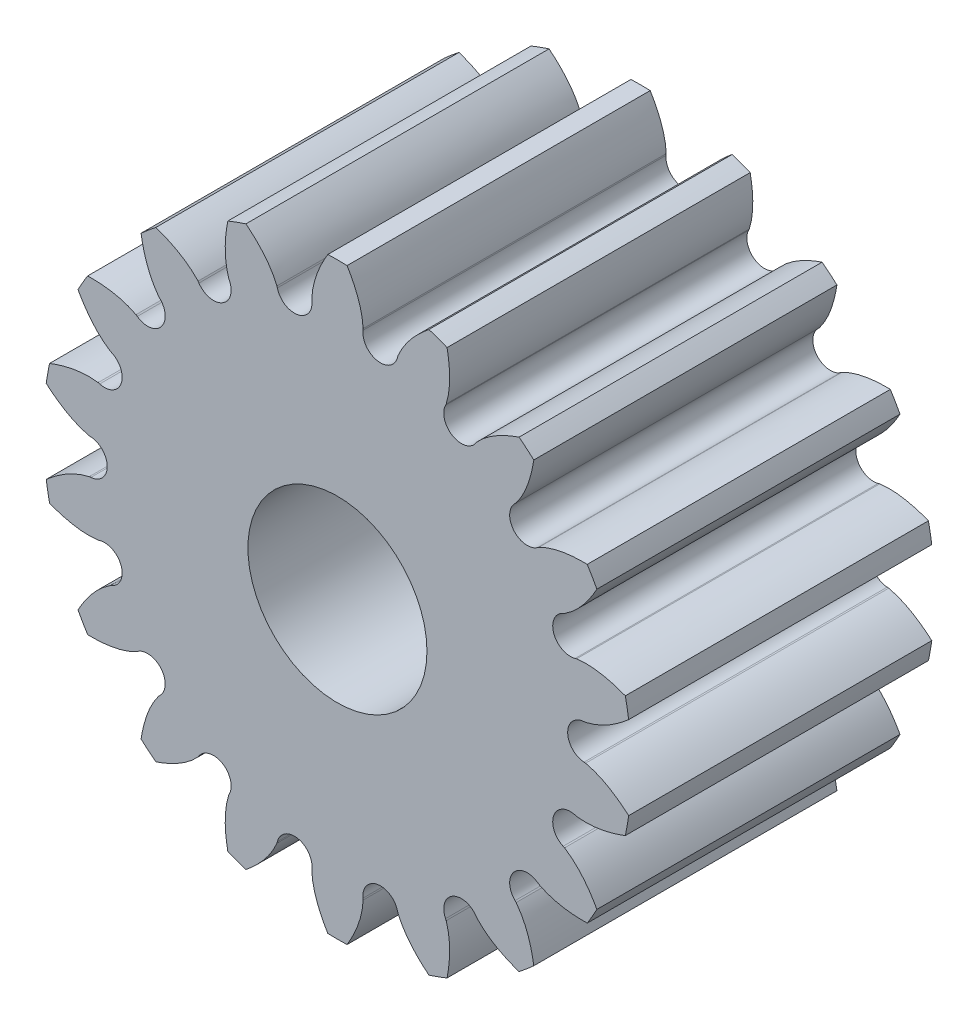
from build123d import *

# Parameters (mm, degrees)
SKETCH3_R                           = 2.286
SKETCH3_R_2                         = 0.889
BASE_DEPTH                          = 3.0099
HALF_TOOTH_DEPTH                    = 3.0099
PATTERN_OF_HALF_TOOTH_COUNT         = 18
PATTERN_OF_HALF_TOOTH_COPY_1_DEPTH  = 3.0099
PATTERN_OF_HALF_TOOTH_COPY_2_DEPTH  = 3.0099
PATTERN_OF_HALF_TOOTH_COPY_3_DEPTH  = 3.0099
PATTERN_OF_HALF_TOOTH_COPY_4_DEPTH  = 3.0099
PATTERN_OF_HALF_TOOTH_COPY_5_DEPTH  = 3.0099
PATTERN_OF_HALF_TOOTH_COPY_6_DEPTH  = 3.0099
PATTERN_OF_HALF_TOOTH_COPY_7_DEPTH  = 3.0099
PATTERN_OF_HALF_TOOTH_COPY_8_DEPTH  = 3.0099
PATTERN_OF_HALF_TOOTH_COPY_9_DEPTH  = 3.0099
PATTERN_OF_HALF_TOOTH_COPY_10_DEPTH = 3.0099
PATTERN_OF_HALF_TOOTH_COPY_11_DEPTH = 3.0099
PATTERN_OF_HALF_TOOTH_COPY_12_DEPTH = 3.0099
PATTERN_OF_HALF_TOOTH_COPY_13_DEPTH = 3.0099
PATTERN_OF_HALF_TOOTH_COPY_14_DEPTH = 3.0099
PATTERN_OF_HALF_TOOTH_COPY_15_DEPTH = 3.0099
PATTERN_OF_HALF_TOOTH_COPY_16_DEPTH = 3.0099
PATTERN_OF_HALF_TOOTH_COPY_17_DEPTH = 3.0099


with BuildPart() as part:
    # Sketch3 → Base (new body)
    with BuildSketch(Plane.XY):
        Circle(SKETCH3_R)
        Circle(SKETCH3_R_2, mode=Mode.SUBTRACT)
    extrude(amount=BASE_DEPTH)

    # Sketch2 → Half tooth (add)
    with BuildSketch(Plane.XY):
        with BuildLine():
            Line((0, 2.921), (0, 2.286))
            ThreePointArc((0, 2.286), (0.199238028, 2.27730108), (0.396959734, 2.251270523))
            ThreePointArc((0.396959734, 2.251270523), (0.28773176, 2.318156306), (0.253382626, 2.441544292))
            Line((0.253382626, 2.441544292), (0.255003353, 2.457161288))
            add(Edge.make_bspline(
                [(0.255003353, 2.457161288), (0.25245669, 2.511970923), (0.22493294, 2.674677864), (0.152013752, 2.825486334), (0.095650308, 2.91943351)],
                knots=[0, 0, 0, 0, 0.332628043, 1, 1, 1, 1], degree=3))
            ThreePointArc((0.095650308, 2.91943351), (0.047831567, 2.920608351), (0, 2.921))
        make_face()
    half_tooth = extrude(amount=HALF_TOOTH_DEPTH)

    # Mirror of half tooth: Half tooth across plane
    add(half_tooth.mirror(Plane.ZY))

    # Pattern of half tooth: Half tooth ×18 about axis
    pattern_of_half_tooth_axis = Axis((0, 0, 0), (0, 0, -1))
    for i in range(1, PATTERN_OF_HALF_TOOTH_COUNT):
        add(half_tooth.rotate(pattern_of_half_tooth_axis, i * 360 / PATTERN_OF_HALF_TOOTH_COUNT))

    # Pattern of half tooth copy 1 sketch → Pattern of half tooth copy 1 (add)
    with BuildSketch(Plane(origin=(0, 0, 0), x_dir=(-0.9396926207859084, 0.3420201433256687, 0), z_dir=(0, 0, 1))):
        with BuildLine():
            Line((0, -2.921), (0, -2.286))
            ThreePointArc((0, -2.286), (0.199238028, -2.27730108), (0.396959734, -2.251270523))
            ThreePointArc((0.396959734, -2.251270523), (0.28773176, -2.318156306), (0.253382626, -2.441544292))
            Line((0.253382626, -2.441544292), (0.255003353, -2.457161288))
            add(Edge.make_bspline(
                [(0.255003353, -2.457161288), (0.25245669, -2.511970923), (0.22493294, -2.674677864), (0.152013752, -2.825486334), (0.095650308, -2.91943351)],
                knots=[0, 0, 0, 0, 0.332628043, 1, 1, 1, 1], degree=3))
            ThreePointArc((0.095650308, -2.91943351), (0.047831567, -2.920608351), (0, -2.921))
        make_face()
    extrude(amount=PATTERN_OF_HALF_TOOTH_COPY_1_DEPTH)

    # Pattern of half tooth copy 2 sketch → Pattern of half tooth copy 2 (add)
    with BuildSketch(Plane(origin=(0, 0, 0), x_dir=(-0.766044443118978, 0.6427876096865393, 0), z_dir=(0, 0, 1))):
        with BuildLine():
            Line((0, -2.921), (0, -2.286))
            ThreePointArc((0, -2.286), (0.199238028, -2.27730108), (0.396959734, -2.251270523))
            ThreePointArc((0.396959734, -2.251270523), (0.28773176, -2.318156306), (0.253382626, -2.441544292))
            Line((0.253382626, -2.441544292), (0.255003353, -2.457161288))
            add(Edge.make_bspline(
                [(0.255003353, -2.457161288), (0.25245669, -2.511970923), (0.22493294, -2.674677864), (0.152013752, -2.825486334), (0.095650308, -2.91943351)],
                knots=[0, 0, 0, 0, 0.332628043, 1, 1, 1, 1], degree=3))
            ThreePointArc((0.095650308, -2.91943351), (0.047831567, -2.920608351), (0, -2.921))
        make_face()
    extrude(amount=PATTERN_OF_HALF_TOOTH_COPY_2_DEPTH)

    # Pattern of half tooth copy 3 sketch → Pattern of half tooth copy 3 (add)
    with BuildSketch(Plane(origin=(0, 0, 0), x_dir=(-0.5000000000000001, 0.8660254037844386, 0), z_dir=(0, 0, 1))):
        with BuildLine():
            Line((0, -2.921), (0, -2.286))
            ThreePointArc((0, -2.286), (0.199238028, -2.27730108), (0.396959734, -2.251270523))
            ThreePointArc((0.396959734, -2.251270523), (0.28773176, -2.318156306), (0.253382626, -2.441544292))
            Line((0.253382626, -2.441544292), (0.255003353, -2.457161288))
            add(Edge.make_bspline(
                [(0.255003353, -2.457161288), (0.25245669, -2.511970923), (0.22493294, -2.674677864), (0.152013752, -2.825486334), (0.095650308, -2.91943351)],
                knots=[0, 0, 0, 0, 0.332628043, 1, 1, 1, 1], degree=3))
            ThreePointArc((0.095650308, -2.91943351), (0.047831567, -2.920608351), (0, -2.921))
        make_face()
    extrude(amount=PATTERN_OF_HALF_TOOTH_COPY_3_DEPTH)

    # Pattern of half tooth copy 4 sketch → Pattern of half tooth copy 4 (add)
    with BuildSketch(Plane(origin=(0, 0, 0), x_dir=(-0.17364817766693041, 0.984807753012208, 0), z_dir=(0, 0, 1))):
        with BuildLine():
            Line((0, -2.921), (0, -2.286))
            ThreePointArc((0, -2.286), (0.199238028, -2.27730108), (0.396959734, -2.251270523))
            ThreePointArc((0.396959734, -2.251270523), (0.28773176, -2.318156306), (0.253382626, -2.441544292))
            Line((0.253382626, -2.441544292), (0.255003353, -2.457161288))
            add(Edge.make_bspline(
                [(0.255003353, -2.457161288), (0.25245669, -2.511970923), (0.22493294, -2.674677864), (0.152013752, -2.825486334), (0.095650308, -2.91943351)],
                knots=[0, 0, 0, 0, 0.332628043, 1, 1, 1, 1], degree=3))
            ThreePointArc((0.095650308, -2.91943351), (0.047831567, -2.920608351), (0, -2.921))
        make_face()
    extrude(amount=PATTERN_OF_HALF_TOOTH_COPY_4_DEPTH)

    # Pattern of half tooth copy 5 sketch → Pattern of half tooth copy 5 (add)
    with BuildSketch(Plane(origin=(0, 0, 0), x_dir=(0.1736481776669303, 0.984807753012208, 0), z_dir=(0, 0, 1))):
        with BuildLine():
            Line((0, -2.921), (0, -2.286))
            ThreePointArc((0, -2.286), (0.199238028, -2.27730108), (0.396959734, -2.251270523))
            ThreePointArc((0.396959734, -2.251270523), (0.28773176, -2.318156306), (0.253382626, -2.441544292))
            Line((0.253382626, -2.441544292), (0.255003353, -2.457161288))
            add(Edge.make_bspline(
                [(0.255003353, -2.457161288), (0.25245669, -2.511970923), (0.22493294, -2.674677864), (0.152013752, -2.825486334), (0.095650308, -2.91943351)],
                knots=[0, 0, 0, 0, 0.332628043, 1, 1, 1, 1], degree=3))
            ThreePointArc((0.095650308, -2.91943351), (0.047831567, -2.920608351), (0, -2.921))
        make_face()
    extrude(amount=PATTERN_OF_HALF_TOOTH_COPY_5_DEPTH)

    # Pattern of half tooth copy 6 sketch → Pattern of half tooth copy 6 (add)
    with BuildSketch(Plane(origin=(0, 0, 0), x_dir=(0.4999999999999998, 0.8660254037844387, 0), z_dir=(0, 0, 1))):
        with BuildLine():
            Line((0, -2.921), (0, -2.286))
            ThreePointArc((0, -2.286), (0.199238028, -2.27730108), (0.396959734, -2.251270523))
            ThreePointArc((0.396959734, -2.251270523), (0.28773176, -2.318156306), (0.253382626, -2.441544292))
            Line((0.253382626, -2.441544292), (0.255003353, -2.457161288))
            add(Edge.make_bspline(
                [(0.255003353, -2.457161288), (0.25245669, -2.511970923), (0.22493294, -2.674677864), (0.152013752, -2.825486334), (0.095650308, -2.91943351)],
                knots=[0, 0, 0, 0, 0.332628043, 1, 1, 1, 1], degree=3))
            ThreePointArc((0.095650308, -2.91943351), (0.047831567, -2.920608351), (0, -2.921))
        make_face()
    extrude(amount=PATTERN_OF_HALF_TOOTH_COPY_6_DEPTH)

    # Pattern of half tooth copy 7 sketch → Pattern of half tooth copy 7 (add)
    with BuildSketch(Plane(origin=(0, 0, 0), x_dir=(0.7660444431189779, 0.6427876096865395, 0), z_dir=(0, 0, 1))):
        with BuildLine():
            Line((0, -2.921), (0, -2.286))
            ThreePointArc((0, -2.286), (0.199238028, -2.27730108), (0.396959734, -2.251270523))
            ThreePointArc((0.396959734, -2.251270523), (0.28773176, -2.318156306), (0.253382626, -2.441544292))
            Line((0.253382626, -2.441544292), (0.255003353, -2.457161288))
            add(Edge.make_bspline(
                [(0.255003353, -2.457161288), (0.25245669, -2.511970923), (0.22493294, -2.674677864), (0.152013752, -2.825486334), (0.095650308, -2.91943351)],
                knots=[0, 0, 0, 0, 0.332628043, 1, 1, 1, 1], degree=3))
            ThreePointArc((0.095650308, -2.91943351), (0.047831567, -2.920608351), (0, -2.921))
        make_face()
    extrude(amount=PATTERN_OF_HALF_TOOTH_COPY_7_DEPTH)

    # Pattern of half tooth copy 8 sketch → Pattern of half tooth copy 8 (add)
    with BuildSketch(Plane(origin=(0, 0, 0), x_dir=(0.9396926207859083, 0.3420201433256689, 0), z_dir=(0, 0, 1))):
        with BuildLine():
            Line((0, -2.921), (0, -2.286))
            ThreePointArc((0, -2.286), (0.199238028, -2.27730108), (0.396959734, -2.251270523))
            ThreePointArc((0.396959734, -2.251270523), (0.28773176, -2.318156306), (0.253382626, -2.441544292))
            Line((0.253382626, -2.441544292), (0.255003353, -2.457161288))
            add(Edge.make_bspline(
                [(0.255003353, -2.457161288), (0.25245669, -2.511970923), (0.22493294, -2.674677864), (0.152013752, -2.825486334), (0.095650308, -2.91943351)],
                knots=[0, 0, 0, 0, 0.332628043, 1, 1, 1, 1], degree=3))
            ThreePointArc((0.095650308, -2.91943351), (0.047831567, -2.920608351), (0, -2.921))
        make_face()
    extrude(amount=PATTERN_OF_HALF_TOOTH_COPY_8_DEPTH)

    # Pattern of half tooth copy 9 sketch → Pattern of half tooth copy 9 (add)
    with BuildSketch(Plane.XY):
        with BuildLine():
            Line((0, -2.921), (0, -2.286))
            ThreePointArc((0, -2.286), (0.199238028, -2.27730108), (0.396959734, -2.251270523))
            ThreePointArc((0.396959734, -2.251270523), (0.28773176, -2.318156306), (0.253382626, -2.441544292))
            Line((0.253382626, -2.441544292), (0.255003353, -2.457161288))
            add(Edge.make_bspline(
                [(0.255003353, -2.457161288), (0.25245669, -2.511970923), (0.22493294, -2.674677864), (0.152013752, -2.825486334), (0.095650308, -2.91943351)],
                knots=[0, 0, 0, 0, 0.332628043, 1, 1, 1, 1], degree=3))
            ThreePointArc((0.095650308, -2.91943351), (0.047831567, -2.920608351), (0, -2.921))
        make_face()
    extrude(amount=PATTERN_OF_HALF_TOOTH_COPY_9_DEPTH)

    # Pattern of half tooth copy 10 sketch → Pattern of half tooth copy 10 (add)
    with BuildSketch(Plane(origin=(0, 0, 0), x_dir=(0.9396926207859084, -0.34202014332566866, 0), z_dir=(0, 0, 1))):
        with BuildLine():
            Line((0, -2.921), (0, -2.286))
            ThreePointArc((0, -2.286), (0.199238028, -2.27730108), (0.396959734, -2.251270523))
            ThreePointArc((0.396959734, -2.251270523), (0.28773176, -2.318156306), (0.253382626, -2.441544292))
            Line((0.253382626, -2.441544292), (0.255003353, -2.457161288))
            add(Edge.make_bspline(
                [(0.255003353, -2.457161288), (0.25245669, -2.511970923), (0.22493294, -2.674677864), (0.152013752, -2.825486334), (0.095650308, -2.91943351)],
                knots=[0, 0, 0, 0, 0.332628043, 1, 1, 1, 1], degree=3))
            ThreePointArc((0.095650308, -2.91943351), (0.047831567, -2.920608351), (0, -2.921))
        make_face()
    extrude(amount=PATTERN_OF_HALF_TOOTH_COPY_10_DEPTH)

    # Pattern of half tooth copy 11 sketch → Pattern of half tooth copy 11 (add)
    with BuildSketch(Plane(origin=(0, 0, 0), x_dir=(0.766044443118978, -0.6427876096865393, 0), z_dir=(0, 0, 1))):
        with BuildLine():
            Line((0, -2.921), (0, -2.286))
            ThreePointArc((0, -2.286), (0.199238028, -2.27730108), (0.396959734, -2.251270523))
            ThreePointArc((0.396959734, -2.251270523), (0.28773176, -2.318156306), (0.253382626, -2.441544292))
            Line((0.253382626, -2.441544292), (0.255003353, -2.457161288))
            add(Edge.make_bspline(
                [(0.255003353, -2.457161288), (0.25245669, -2.511970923), (0.22493294, -2.674677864), (0.152013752, -2.825486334), (0.095650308, -2.91943351)],
                knots=[0, 0, 0, 0, 0.332628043, 1, 1, 1, 1], degree=3))
            ThreePointArc((0.095650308, -2.91943351), (0.047831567, -2.920608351), (0, -2.921))
        make_face()
    extrude(amount=PATTERN_OF_HALF_TOOTH_COPY_11_DEPTH)

    # Pattern of half tooth copy 12 sketch → Pattern of half tooth copy 12 (add)
    with BuildSketch(Plane(origin=(0, 0, 0), x_dir=(0.5000000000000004, -0.8660254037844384, 0), z_dir=(0, 0, 1))):
        with BuildLine():
            Line((0, -2.921), (0, -2.286))
            ThreePointArc((0, -2.286), (0.199238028, -2.27730108), (0.396959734, -2.251270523))
            ThreePointArc((0.396959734, -2.251270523), (0.28773176, -2.318156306), (0.253382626, -2.441544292))
            Line((0.253382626, -2.441544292), (0.255003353, -2.457161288))
            add(Edge.make_bspline(
                [(0.255003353, -2.457161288), (0.25245669, -2.511970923), (0.22493294, -2.674677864), (0.152013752, -2.825486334), (0.095650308, -2.91943351)],
                knots=[0, 0, 0, 0, 0.332628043, 1, 1, 1, 1], degree=3))
            ThreePointArc((0.095650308, -2.91943351), (0.047831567, -2.920608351), (0, -2.921))
        make_face()
    extrude(amount=PATTERN_OF_HALF_TOOTH_COPY_12_DEPTH)

    # Pattern of half tooth copy 13 sketch → Pattern of half tooth copy 13 (add)
    with BuildSketch(Plane(origin=(0, 0, 0), x_dir=(0.17364817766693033, -0.984807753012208, 0), z_dir=(0, 0, 1))):
        with BuildLine():
            Line((0, -2.921), (0, -2.286))
            ThreePointArc((0, -2.286), (0.199238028, -2.27730108), (0.396959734, -2.251270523))
            ThreePointArc((0.396959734, -2.251270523), (0.28773176, -2.318156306), (0.253382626, -2.441544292))
            Line((0.253382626, -2.441544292), (0.255003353, -2.457161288))
            add(Edge.make_bspline(
                [(0.255003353, -2.457161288), (0.25245669, -2.511970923), (0.22493294, -2.674677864), (0.152013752, -2.825486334), (0.095650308, -2.91943351)],
                knots=[0, 0, 0, 0, 0.332628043, 1, 1, 1, 1], degree=3))
            ThreePointArc((0.095650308, -2.91943351), (0.047831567, -2.920608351), (0, -2.921))
        make_face()
    extrude(amount=PATTERN_OF_HALF_TOOTH_COPY_13_DEPTH)

    # Pattern of half tooth copy 14 sketch → Pattern of half tooth copy 14 (add)
    with BuildSketch(Plane(origin=(0, 0, 0), x_dir=(-0.17364817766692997, -0.9848077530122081, 0), z_dir=(0, 0, 1))):
        with BuildLine():
            Line((0, -2.921), (0, -2.286))
            ThreePointArc((0, -2.286), (0.199238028, -2.27730108), (0.396959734, -2.251270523))
            ThreePointArc((0.396959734, -2.251270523), (0.28773176, -2.318156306), (0.253382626, -2.441544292))
            Line((0.253382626, -2.441544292), (0.255003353, -2.457161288))
            add(Edge.make_bspline(
                [(0.255003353, -2.457161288), (0.25245669, -2.511970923), (0.22493294, -2.674677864), (0.152013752, -2.825486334), (0.095650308, -2.91943351)],
                knots=[0, 0, 0, 0, 0.332628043, 1, 1, 1, 1], degree=3))
            ThreePointArc((0.095650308, -2.91943351), (0.047831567, -2.920608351), (0, -2.921))
        make_face()
    extrude(amount=PATTERN_OF_HALF_TOOTH_COPY_14_DEPTH)

    # Pattern of half tooth copy 15 sketch → Pattern of half tooth copy 15 (add)
    with BuildSketch(Plane(origin=(0, 0, 0), x_dir=(-0.5000000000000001, -0.8660254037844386, 0), z_dir=(0, 0, 1))):
        with BuildLine():
            Line((0, -2.921), (0, -2.286))
            ThreePointArc((0, -2.286), (0.199238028, -2.27730108), (0.396959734, -2.251270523))
            ThreePointArc((0.396959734, -2.251270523), (0.28773176, -2.318156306), (0.253382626, -2.441544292))
            Line((0.253382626, -2.441544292), (0.255003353, -2.457161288))
            add(Edge.make_bspline(
                [(0.255003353, -2.457161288), (0.25245669, -2.511970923), (0.22493294, -2.674677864), (0.152013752, -2.825486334), (0.095650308, -2.91943351)],
                knots=[0, 0, 0, 0, 0.332628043, 1, 1, 1, 1], degree=3))
            ThreePointArc((0.095650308, -2.91943351), (0.047831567, -2.920608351), (0, -2.921))
        make_face()
    extrude(amount=PATTERN_OF_HALF_TOOTH_COPY_15_DEPTH)

    # Pattern of half tooth copy 16 sketch → Pattern of half tooth copy 16 (add)
    with BuildSketch(Plane(origin=(0, 0, 0), x_dir=(-0.7660444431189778, -0.6427876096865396, 0), z_dir=(0, 0, 1))):
        with BuildLine():
            Line((0, -2.921), (0, -2.286))
            ThreePointArc((0, -2.286), (0.199238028, -2.27730108), (0.396959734, -2.251270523))
            ThreePointArc((0.396959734, -2.251270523), (0.28773176, -2.318156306), (0.253382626, -2.441544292))
            Line((0.253382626, -2.441544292), (0.255003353, -2.457161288))
            add(Edge.make_bspline(
                [(0.255003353, -2.457161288), (0.25245669, -2.511970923), (0.22493294, -2.674677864), (0.152013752, -2.825486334), (0.095650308, -2.91943351)],
                knots=[0, 0, 0, 0, 0.332628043, 1, 1, 1, 1], degree=3))
            ThreePointArc((0.095650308, -2.91943351), (0.047831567, -2.920608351), (0, -2.921))
        make_face()
    extrude(amount=PATTERN_OF_HALF_TOOTH_COPY_16_DEPTH)

    # Pattern of half tooth copy 17 sketch → Pattern of half tooth copy 17 (add)
    with BuildSketch(Plane(origin=(0, 0, 0), x_dir=(-0.9396926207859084, -0.3420201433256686, 0), z_dir=(0, 0, 1))):
        with BuildLine():
            Line((0, -2.921), (0, -2.286))
            ThreePointArc((0, -2.286), (0.199238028, -2.27730108), (0.396959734, -2.251270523))
            ThreePointArc((0.396959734, -2.251270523), (0.28773176, -2.318156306), (0.253382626, -2.441544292))
            Line((0.253382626, -2.441544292), (0.255003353, -2.457161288))
            add(Edge.make_bspline(
                [(0.255003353, -2.457161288), (0.25245669, -2.511970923), (0.22493294, -2.674677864), (0.152013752, -2.825486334), (0.095650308, -2.91943351)],
                knots=[0, 0, 0, 0, 0.332628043, 1, 1, 1, 1], degree=3))
            ThreePointArc((0.095650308, -2.91943351), (0.047831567, -2.920608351), (0, -2.921))
        make_face()
    extrude(amount=PATTERN_OF_HALF_TOOTH_COPY_17_DEPTH)


solid = part.part
